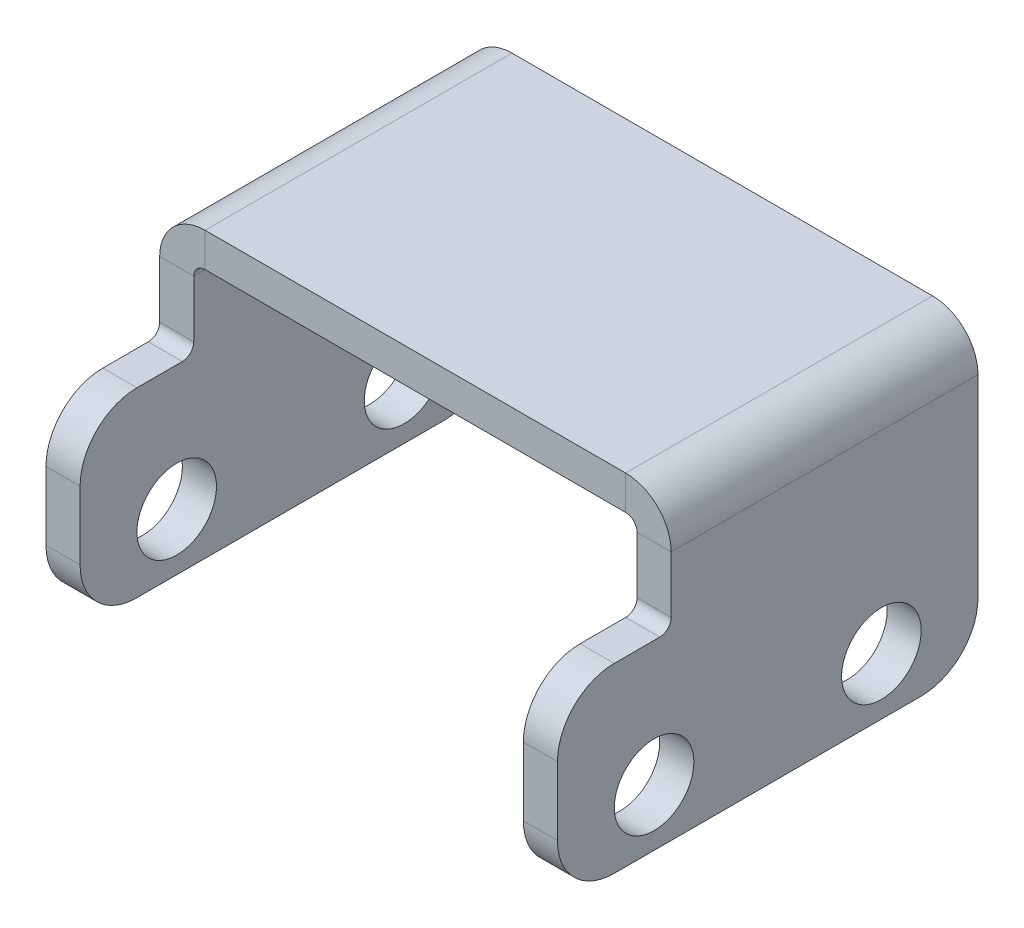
ISO-10303-21;
HEADER;
FILE_DESCRIPTION(('STEP AP214'),'2;1');
FILE_NAME('part.step','',(''),(''),'','','');
FILE_SCHEMA(('AUTOMOTIVE_DESIGN { 1 0 10303 214 1 1 1 1 }'));
ENDSEC;
DATA;
#1=APPLICATION_CONTEXT('core data for automotive mechanical design processes');
#2=APPLICATION_PROTOCOL_DEFINITION('international standard','automotive_design',2000,#1);
#3=PRODUCT_CONTEXT('',#1,'mechanical');
#4=PRODUCT('Part','Part','',(#3));
#5=PRODUCT_RELATED_PRODUCT_CATEGORY('part','',(#4));
#6=PRODUCT_DEFINITION_FORMATION('','',#4);
#7=PRODUCT_DEFINITION_CONTEXT('part definition',#1,'design');
#8=PRODUCT_DEFINITION('design','',#6,#7);
#9=PRODUCT_DEFINITION_SHAPE('','',#8);
#10=(LENGTH_UNIT() NAMED_UNIT(*) SI_UNIT(.MILLI.,.METRE.));
#11=(NAMED_UNIT(*) PLANE_ANGLE_UNIT() SI_UNIT($,.RADIAN.));
#12=(NAMED_UNIT(*) SI_UNIT($,.STERADIAN.) SOLID_ANGLE_UNIT());
#13=UNCERTAINTY_MEASURE_WITH_UNIT(LENGTH_MEASURE(1.E-05),#10,'distance_accuracy_value','');
#14=(GEOMETRIC_REPRESENTATION_CONTEXT(3) GLOBAL_UNCERTAINTY_ASSIGNED_CONTEXT((#13)) GLOBAL_UNIT_ASSIGNED_CONTEXT((#10,
#11,#12)) REPRESENTATION_CONTEXT('',''));
#15=CARTESIAN_POINT('',(0.,0.,0.));
#16=DIRECTION('',(0.,0.,1.));
#17=DIRECTION('',(1.,0.,0.));
#18=AXIS2_PLACEMENT_3D('',#15,#16,#17);
#19=CARTESIAN_POINT('',(-22.5,0.,-10.));
#20=DIRECTION('',(1.,0.,0.));
#21=DIRECTION('',(0.,0.,-1.));
#22=AXIS2_PLACEMENT_3D('',#19,#20,#21);
#23=CYLINDRICAL_SURFACE('',#22,3.5);
#24=CARTESIAN_POINT('',(-19.5,0.,-10.));
#25=DIRECTION('',(1.,0.,0.));
#26=DIRECTION('',(0.,1.,0.));
#27=AXIS2_PLACEMENT_3D('',#24,#25,#26);
#28=CIRCLE('',#27,3.5);
#29=CARTESIAN_POINT('',(-19.5,3.50000000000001,-10.));
#30=VERTEX_POINT('',#29);
#31=EDGE_CURVE('E350',#30,#30,#28,.T.);
#32=ORIENTED_EDGE('',*,*,#31,.T.);
#33=EDGE_LOOP('',(#32));
#34=FACE_BOUND('',#33,.T.);
#35=CARTESIAN_POINT('',(-22.5,0.,-10.));
#36=DIRECTION('',(1.,0.,0.));
#37=DIRECTION('',(0.,0.,-1.));
#38=AXIS2_PLACEMENT_3D('',#35,#36,#37);
#39=CIRCLE('',#38,3.5);
#40=CARTESIAN_POINT('',(-22.5,0.,-13.5));
#41=VERTEX_POINT('',#40);
#42=EDGE_CURVE('E379',#41,#41,#39,.T.);
#43=ORIENTED_EDGE('',*,*,#42,.F.);
#44=EDGE_LOOP('',(#43));
#45=FACE_BOUND('',#44,.T.);
#46=ADVANCED_FACE('F28',(#34,#45),#23,.F.);
#47=CARTESIAN_POINT('',(-22.5,-4.99999999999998,18.5));
#48=DIRECTION('',(-1.,0.,0.));
#49=DIRECTION('',(0.,-1.,0.));
#50=AXIS2_PLACEMENT_3D('',#47,#48,#49);
#51=PLANE('',#50);
#52=DIRECTION('',(0.,0.,1.));
#53=VECTOR('',#52,1.);
#54=CARTESIAN_POINT('',(-22.5,17.,8.5));
#55=LINE('',#54,#53);
#56=CARTESIAN_POINT('',(-22.5,17.,-18.5));
#57=VERTEX_POINT('',#56);
#58=CARTESIAN_POINT('',(-22.5,17.,8.5));
#59=VERTEX_POINT('',#58);
#60=EDGE_CURVE('E384',#57,#59,#55,.T.);
#61=ORIENTED_EDGE('',*,*,#60,.F.);
#62=DIRECTION('',(0.,1.,0.));
#63=VECTOR('',#62,1.);
#64=CARTESIAN_POINT('',(-22.5,-4.99999999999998,-18.5));
#65=LINE('',#64,#63);
#66=CARTESIAN_POINT('',(-22.5,0.,-18.5));
#67=VERTEX_POINT('',#66);
#68=EDGE_CURVE('E369',#67,#57,#65,.T.);
#69=ORIENTED_EDGE('',*,*,#68,.F.);
#70=CARTESIAN_POINT('',(-22.5,0.,-13.5));
#71=DIRECTION('',(-1.,0.,0.));
#72=DIRECTION('',(0.,-1.,0.));
#73=AXIS2_PLACEMENT_3D('',#70,#71,#72);
#74=CIRCLE('',#73,5.);
#75=CARTESIAN_POINT('',(-22.5,-4.99999999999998,-13.5));
#76=VERTEX_POINT('',#75);
#77=EDGE_CURVE('E372',#67,#76,#74,.T.);
#78=ORIENTED_EDGE('',*,*,#77,.T.);
#79=DIRECTION('',(0.,0.,-1.));
#80=VECTOR('',#79,1.);
#81=CARTESIAN_POINT('',(-22.5,-4.99999999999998,18.5));
#82=LINE('',#81,#80);
#83=CARTESIAN_POINT('',(-22.5,-4.99999999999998,13.5));
#84=VERTEX_POINT('',#83);
#85=EDGE_CURVE('E374',#84,#76,#82,.T.);
#86=ORIENTED_EDGE('',*,*,#85,.F.);
#87=CARTESIAN_POINT('',(-22.5,0.,13.5));
#88=DIRECTION('',(-1.,0.,0.));
#89=DIRECTION('',(0.,-1.,0.));
#90=AXIS2_PLACEMENT_3D('',#87,#88,#89);
#91=CIRCLE('',#90,5.);
#92=CARTESIAN_POINT('',(-22.5,0.,18.5));
#93=VERTEX_POINT('',#92);
#94=EDGE_CURVE('E377',#84,#93,#91,.T.);
#95=ORIENTED_EDGE('',*,*,#94,.T.);
#96=DIRECTION('',(0.,1.,0.));
#97=VECTOR('',#96,1.);
#98=CARTESIAN_POINT('',(-22.5,-4.99999999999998,18.5));
#99=LINE('',#98,#97);
#100=CARTESIAN_POINT('',(-22.5,6.00000000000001,18.5));
#101=VERTEX_POINT('',#100);
#102=EDGE_CURVE('E356',#93,#101,#99,.T.);
#103=ORIENTED_EDGE('',*,*,#102,.T.);
#104=CARTESIAN_POINT('',(-22.5,6.00000000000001,13.5));
#105=DIRECTION('',(-1.,0.,0.));
#106=DIRECTION('',(0.,-1.,0.));
#107=AXIS2_PLACEMENT_3D('',#104,#105,#106);
#108=CIRCLE('',#107,5.);
#109=CARTESIAN_POINT('',(-22.5,11.,13.5));
#110=VERTEX_POINT('',#109);
#111=EDGE_CURVE('E358',#101,#110,#108,.T.);
#112=ORIENTED_EDGE('',*,*,#111,.T.);
#113=DIRECTION('',(0.,0.,1.));
#114=VECTOR('',#113,1.);
#115=CARTESIAN_POINT('',(-22.5,11.,18.5));
#116=LINE('',#115,#114);
#117=CARTESIAN_POINT('',(-22.5,11.,9.50000000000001));
#118=VERTEX_POINT('',#117);
#119=EDGE_CURVE('E360',#118,#110,#116,.T.);
#120=ORIENTED_EDGE('',*,*,#119,.F.);
#121=CARTESIAN_POINT('',(-22.5,12.,9.5));
#122=DIRECTION('',(-1.,0.,0.));
#123=DIRECTION('',(0.,0.,1.));
#124=AXIS2_PLACEMENT_3D('',#121,#122,#123);
#125=CIRCLE('',#124,1.);
#126=CARTESIAN_POINT('',(-22.5,12.,8.5));
#127=VERTEX_POINT('',#126);
#128=EDGE_CURVE('E363',#127,#118,#125,.T.);
#129=ORIENTED_EDGE('',*,*,#128,.F.);
#130=DIRECTION('',(0.,-1.,0.));
#131=VECTOR('',#130,1.);
#132=CARTESIAN_POINT('',(-22.5,21.,8.5));
#133=LINE('',#132,#131);
#134=EDGE_CURVE('E366',#59,#127,#133,.T.);
#135=ORIENTED_EDGE('',*,*,#134,.F.);
#136=EDGE_LOOP('',(#61,#69,#78,#86,#95,#103,#112,#120,#129,#135));
#137=FACE_BOUND('',#136,.T.);
#138=CARTESIAN_POINT('',(-22.5,0.,10.));
#139=DIRECTION('',(1.,0.,0.));
#140=DIRECTION('',(0.,0.,-1.));
#141=AXIS2_PLACEMENT_3D('',#138,#139,#140);
#142=CIRCLE('',#141,3.5);
#143=CARTESIAN_POINT('',(-22.5,0.,6.5));
#144=VERTEX_POINT('',#143);
#145=EDGE_CURVE('E353',#144,#144,#142,.T.);
#146=ORIENTED_EDGE('',*,*,#145,.T.);
#147=EDGE_LOOP('',(#146));
#148=FACE_BOUND('',#147,.T.);
#149=ORIENTED_EDGE('',*,*,#42,.T.);
#150=EDGE_LOOP('',(#149));
#151=FACE_BOUND('',#150,.T.);
#152=ADVANCED_FACE('F460',(#137,#148,#151),#51,.T.);
#153=CARTESIAN_POINT('',(-22.5,0.,10.));
#154=DIRECTION('',(1.,0.,0.));
#155=DIRECTION('',(0.,0.,-1.));
#156=AXIS2_PLACEMENT_3D('',#153,#154,#155);
#157=CYLINDRICAL_SURFACE('',#156,3.5);
#158=CARTESIAN_POINT('',(-19.5,0.,10.));
#159=DIRECTION('',(1.,0.,0.));
#160=DIRECTION('',(0.,1.,0.));
#161=AXIS2_PLACEMENT_3D('',#158,#159,#160);
#162=CIRCLE('',#161,3.5);
#163=CARTESIAN_POINT('',(-19.5,3.50000000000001,10.));
#164=VERTEX_POINT('',#163);
#165=EDGE_CURVE('E347',#164,#164,#162,.T.);
#166=ORIENTED_EDGE('',*,*,#165,.T.);
#167=EDGE_LOOP('',(#166));
#168=FACE_BOUND('',#167,.T.);
#169=ORIENTED_EDGE('',*,*,#145,.F.);
#170=EDGE_LOOP('',(#169));
#171=FACE_BOUND('',#170,.T.);
#172=ADVANCED_FACE('F463',(#168,#171),#157,.F.);
#173=CARTESIAN_POINT('',(-19.5,18.,18.5));
#174=DIRECTION('',(1.,0.,0.));
#175=DIRECTION('',(0.,1.,0.));
#176=AXIS2_PLACEMENT_3D('',#173,#174,#175);
#177=PLANE('',#176);
#178=DIRECTION('',(0.,0.,-1.));
#179=VECTOR('',#178,1.);
#180=CARTESIAN_POINT('',(-19.5,17.,8.5));
#181=LINE('',#180,#179);
#182=CARTESIAN_POINT('',(-19.5,17.,8.50000000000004));
#183=VERTEX_POINT('',#182);
#184=CARTESIAN_POINT('',(-19.5,17.,-18.5));
#185=VERTEX_POINT('',#184);
#186=EDGE_CURVE('E382',#183,#185,#181,.T.);
#187=ORIENTED_EDGE('',*,*,#186,.F.);
#188=DIRECTION('',(0.,1.,0.));
#189=VECTOR('',#188,1.);
#190=CARTESIAN_POINT('',(-19.5,18.,8.5));
#191=LINE('',#190,#189);
#192=CARTESIAN_POINT('',(-19.5,12.,8.5));
#193=VERTEX_POINT('',#192);
#194=EDGE_CURVE('E341',#193,#183,#191,.T.);
#195=ORIENTED_EDGE('',*,*,#194,.F.);
#196=CARTESIAN_POINT('',(-19.5,12.,9.5));
#197=DIRECTION('',(1.,0.,0.));
#198=DIRECTION('',(0.,1.,0.));
#199=AXIS2_PLACEMENT_3D('',#196,#197,#198);
#200=CIRCLE('',#199,1.);
#201=CARTESIAN_POINT('',(-19.5,11.,9.50000000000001));
#202=VERTEX_POINT('',#201);
#203=EDGE_CURVE('E344',#202,#193,#200,.T.);
#204=ORIENTED_EDGE('',*,*,#203,.F.);
#205=DIRECTION('',(0.,0.,-1.));
#206=VECTOR('',#205,1.);
#207=CARTESIAN_POINT('',(-19.5,11.,18.5));
#208=LINE('',#207,#206);
#209=CARTESIAN_POINT('',(-19.5,11.,13.5));
#210=VERTEX_POINT('',#209);
#211=EDGE_CURVE('E329',#210,#202,#208,.T.);
#212=ORIENTED_EDGE('',*,*,#211,.F.);
#213=CARTESIAN_POINT('',(-19.5,6.00000000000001,13.5));
#214=DIRECTION('',(1.,0.,0.));
#215=DIRECTION('',(0.,1.,0.));
#216=AXIS2_PLACEMENT_3D('',#213,#214,#215);
#217=CIRCLE('',#216,5.);
#218=CARTESIAN_POINT('',(-19.5,6.00000000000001,18.5));
#219=VERTEX_POINT('',#218);
#220=EDGE_CURVE('E332',#210,#219,#217,.T.);
#221=ORIENTED_EDGE('',*,*,#220,.T.);
#222=DIRECTION('',(0.,-1.,0.));
#223=VECTOR('',#222,1.);
#224=CARTESIAN_POINT('',(-19.5,18.,18.5));
#225=LINE('',#224,#223);
#226=CARTESIAN_POINT('',(-19.5,0.,18.5));
#227=VERTEX_POINT('',#226);
#228=EDGE_CURVE('E334',#219,#227,#225,.T.);
#229=ORIENTED_EDGE('',*,*,#228,.T.);
#230=CARTESIAN_POINT('',(-19.5,0.,13.5));
#231=DIRECTION('',(1.,0.,0.));
#232=DIRECTION('',(0.,1.,0.));
#233=AXIS2_PLACEMENT_3D('',#230,#231,#232);
#234=CIRCLE('',#233,5.);
#235=CARTESIAN_POINT('',(-19.5,-4.99999999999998,13.5));
#236=VERTEX_POINT('',#235);
#237=EDGE_CURVE('E336',#227,#236,#234,.T.);
#238=ORIENTED_EDGE('',*,*,#237,.T.);
#239=DIRECTION('',(0.,0.,-1.));
#240=VECTOR('',#239,1.);
#241=CARTESIAN_POINT('',(-19.5,-4.99999999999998,18.5));
#242=LINE('',#241,#240);
#243=CARTESIAN_POINT('',(-19.5,-4.99999999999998,-13.5));
#244=VERTEX_POINT('',#243);
#245=EDGE_CURVE('E338',#236,#244,#242,.T.);
#246=ORIENTED_EDGE('',*,*,#245,.T.);
#247=CARTESIAN_POINT('',(-19.5,0.,-13.5));
#248=DIRECTION('',(1.,0.,0.));
#249=DIRECTION('',(0.,1.,0.));
#250=AXIS2_PLACEMENT_3D('',#247,#248,#249);
#251=CIRCLE('',#250,5.);
#252=CARTESIAN_POINT('',(-19.5,0.,-18.5));
#253=VERTEX_POINT('',#252);
#254=EDGE_CURVE('E43',#244,#253,#251,.T.);
#255=ORIENTED_EDGE('',*,*,#254,.T.);
#256=DIRECTION('',(0.,-1.,0.));
#257=VECTOR('',#256,1.);
#258=CARTESIAN_POINT('',(-19.5,18.,-18.5));
#259=LINE('',#258,#257);
#260=EDGE_CURVE('E11',#185,#253,#259,.T.);
#261=ORIENTED_EDGE('',*,*,#260,.F.);
#262=EDGE_LOOP('',(#187,#195,#204,#212,#221,#229,#238,#246,#255,#261));
#263=FACE_BOUND('',#262,.T.);
#264=ORIENTED_EDGE('',*,*,#165,.F.);
#265=EDGE_LOOP('',(#264));
#266=FACE_BOUND('',#265,.T.);
#267=ORIENTED_EDGE('',*,*,#31,.F.);
#268=EDGE_LOOP('',(#267));
#269=FACE_BOUND('',#268,.T.);
#270=ADVANCED_FACE('F414',(#263,#266,#269),#177,.T.);
#271=CARTESIAN_POINT('',(63.5929730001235,18.,8.5));
#272=DIRECTION('',(0.,0.,1.));
#273=DIRECTION('',(0.,1.,0.));
#274=AXIS2_PLACEMENT_3D('',#271,#272,#273);
#275=PLANE('',#274);
#276=DIRECTION('',(-1.,0.,0.));
#277=VECTOR('',#276,1.);
#278=CARTESIAN_POINT('',(63.5929730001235,17.,8.5));
#279=LINE('',#278,#277);
#280=EDGE_CURVE('E36',#183,#59,#279,.T.);
#281=ORIENTED_EDGE('',*,*,#280,.T.);
#282=ORIENTED_EDGE('',*,*,#134,.T.);
#283=DIRECTION('',(-1.,0.,0.));
#284=VECTOR('',#283,1.);
#285=CARTESIAN_POINT('',(63.5929730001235,12.,8.5));
#286=LINE('',#285,#284);
#287=EDGE_CURVE('E409',#193,#127,#286,.T.);
#288=ORIENTED_EDGE('',*,*,#287,.F.);
#289=ORIENTED_EDGE('',*,*,#194,.T.);
#290=EDGE_LOOP('',(#281,#282,#288,#289));
#291=FACE_BOUND('',#290,.T.);
#292=ADVANCED_FACE('F30',(#291),#275,.T.);
#293=CARTESIAN_POINT('',(63.5929730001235,12.,9.5));
#294=DIRECTION('',(-1.,0.,0.));
#295=DIRECTION('',(0.,-1.,0.));
#296=AXIS2_PLACEMENT_3D('',#293,#294,#295);
#297=CYLINDRICAL_SURFACE('',#296,1.);
#298=ORIENTED_EDGE('',*,*,#287,.T.);
#299=ORIENTED_EDGE('',*,*,#128,.T.);
#300=DIRECTION('',(-1.,0.,0.));
#301=VECTOR('',#300,1.);
#302=CARTESIAN_POINT('',(63.5929730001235,11.,9.50000000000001));
#303=LINE('',#302,#301);
#304=EDGE_CURVE('E406',#202,#118,#303,.T.);
#305=ORIENTED_EDGE('',*,*,#304,.F.);
#306=ORIENTED_EDGE('',*,*,#203,.T.);
#307=EDGE_LOOP('',(#298,#299,#305,#306));
#308=FACE_BOUND('',#307,.T.);
#309=ADVANCED_FACE('F418',(#308),#297,.F.);
#310=CARTESIAN_POINT('',(63.5929730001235,11.,18.5));
#311=DIRECTION('',(0.,1.,0.));
#312=DIRECTION('',(0.,0.,-1.));
#313=AXIS2_PLACEMENT_3D('',#310,#311,#312);
#314=PLANE('',#313);
#315=ORIENTED_EDGE('',*,*,#304,.T.);
#316=ORIENTED_EDGE('',*,*,#119,.T.);
#317=DIRECTION('',(-1.,0.,0.));
#318=VECTOR('',#317,1.);
#319=CARTESIAN_POINT('',(63.5929730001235,11.,13.5));
#320=LINE('',#319,#318);
#321=EDGE_CURVE('E403',#210,#110,#320,.T.);
#322=ORIENTED_EDGE('',*,*,#321,.F.);
#323=ORIENTED_EDGE('',*,*,#211,.T.);
#324=EDGE_LOOP('',(#315,#316,#322,#323));
#325=FACE_BOUND('',#324,.T.);
#326=ADVANCED_FACE('F420',(#325),#314,.T.);
#327=CARTESIAN_POINT('',(63.5929730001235,5.99999999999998,13.5));
#328=DIRECTION('',(-1.,0.,0.));
#329=DIRECTION('',(0.,-1.,0.));
#330=AXIS2_PLACEMENT_3D('',#327,#328,#329);
#331=CYLINDRICAL_SURFACE('',#330,5.);
#332=ORIENTED_EDGE('',*,*,#111,.F.);
#333=DIRECTION('',(-1.,0.,0.));
#334=VECTOR('',#333,1.);
#335=CARTESIAN_POINT('',(63.5929730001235,5.99999999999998,18.5));
#336=LINE('',#335,#334);
#337=EDGE_CURVE('E400',#219,#101,#336,.T.);
#338=ORIENTED_EDGE('',*,*,#337,.F.);
#339=ORIENTED_EDGE('',*,*,#220,.F.);
#340=ORIENTED_EDGE('',*,*,#321,.T.);
#341=EDGE_LOOP('',(#332,#338,#339,#340));
#342=FACE_BOUND('',#341,.T.);
#343=ADVANCED_FACE('F427',(#342),#331,.T.);
#344=CARTESIAN_POINT('',(63.5929730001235,18.,18.5));
#345=DIRECTION('',(0.,0.,-1.));
#346=DIRECTION('',(0.,-1.,0.));
#347=AXIS2_PLACEMENT_3D('',#344,#345,#346);
#348=PLANE('',#347);
#349=ORIENTED_EDGE('',*,*,#102,.F.);
#350=DIRECTION('',(-1.,0.,0.));
#351=VECTOR('',#350,1.);
#352=CARTESIAN_POINT('',(63.5929730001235,0.,18.5));
#353=LINE('',#352,#351);
#354=EDGE_CURVE('E397',#227,#93,#353,.T.);
#355=ORIENTED_EDGE('',*,*,#354,.F.);
#356=ORIENTED_EDGE('',*,*,#228,.F.);
#357=ORIENTED_EDGE('',*,*,#337,.T.);
#358=EDGE_LOOP('',(#349,#355,#356,#357));
#359=FACE_BOUND('',#358,.T.);
#360=ADVANCED_FACE('F430',(#359),#348,.F.);
#361=CARTESIAN_POINT('',(63.5929730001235,0.,13.5));
#362=DIRECTION('',(-1.,0.,0.));
#363=DIRECTION('',(0.,-1.,0.));
#364=AXIS2_PLACEMENT_3D('',#361,#362,#363);
#365=CYLINDRICAL_SURFACE('',#364,5.);
#366=ORIENTED_EDGE('',*,*,#94,.F.);
#367=DIRECTION('',(-1.,0.,0.));
#368=VECTOR('',#367,1.);
#369=CARTESIAN_POINT('',(63.5929730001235,-5.00000000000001,13.5));
#370=LINE('',#369,#368);
#371=EDGE_CURVE('E394',#236,#84,#370,.T.);
#372=ORIENTED_EDGE('',*,*,#371,.F.);
#373=ORIENTED_EDGE('',*,*,#237,.F.);
#374=ORIENTED_EDGE('',*,*,#354,.T.);
#375=EDGE_LOOP('',(#366,#372,#373,#374));
#376=FACE_BOUND('',#375,.T.);
#377=ADVANCED_FACE('F437',(#376),#365,.T.);
#378=CARTESIAN_POINT('',(63.5929730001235,-5.00000000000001,18.5));
#379=DIRECTION('',(0.,1.,0.));
#380=DIRECTION('',(-1.,0.,0.));
#381=AXIS2_PLACEMENT_3D('',#378,#379,#380);
#382=PLANE('',#381);
#383=ORIENTED_EDGE('',*,*,#85,.T.);
#384=DIRECTION('',(-1.,0.,0.));
#385=VECTOR('',#384,1.);
#386=CARTESIAN_POINT('',(63.5929730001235,-5.00000000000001,-13.5));
#387=LINE('',#386,#385);
#388=EDGE_CURVE('E391',#244,#76,#387,.T.);
#389=ORIENTED_EDGE('',*,*,#388,.F.);
#390=ORIENTED_EDGE('',*,*,#245,.F.);
#391=ORIENTED_EDGE('',*,*,#371,.T.);
#392=EDGE_LOOP('',(#383,#389,#390,#391));
#393=FACE_BOUND('',#392,.T.);
#394=ADVANCED_FACE('F439',(#393),#382,.F.);
#395=CARTESIAN_POINT('',(63.5929730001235,0.,-13.5));
#396=DIRECTION('',(-1.,0.,0.));
#397=DIRECTION('',(0.,-1.,0.));
#398=AXIS2_PLACEMENT_3D('',#395,#396,#397);
#399=CYLINDRICAL_SURFACE('',#398,5.);
#400=ORIENTED_EDGE('',*,*,#77,.F.);
#401=DIRECTION('',(-1.,0.,0.));
#402=VECTOR('',#401,1.);
#403=CARTESIAN_POINT('',(63.5929730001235,0.,-18.5));
#404=LINE('',#403,#402);
#405=EDGE_CURVE('E388',#253,#67,#404,.T.);
#406=ORIENTED_EDGE('',*,*,#405,.F.);
#407=ORIENTED_EDGE('',*,*,#254,.F.);
#408=ORIENTED_EDGE('',*,*,#388,.T.);
#409=EDGE_LOOP('',(#400,#406,#407,#408));
#410=FACE_BOUND('',#409,.T.);
#411=ADVANCED_FACE('F444',(#410),#399,.T.);
#412=CARTESIAN_POINT('',(63.5929730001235,18.,-18.5));
#413=DIRECTION('',(0.,0.,-1.));
#414=DIRECTION('',(0.,-1.,0.));
#415=AXIS2_PLACEMENT_3D('',#412,#413,#414);
#416=PLANE('',#415);
#417=ORIENTED_EDGE('',*,*,#405,.T.);
#418=ORIENTED_EDGE('',*,*,#68,.T.);
#419=DIRECTION('',(-1.,0.,0.));
#420=VECTOR('',#419,1.);
#421=CARTESIAN_POINT('',(63.5929730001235,17.,-18.5));
#422=LINE('',#421,#420);
#423=EDGE_CURVE('E386',#185,#57,#422,.T.);
#424=ORIENTED_EDGE('',*,*,#423,.F.);
#425=ORIENTED_EDGE('',*,*,#260,.T.);
#426=EDGE_LOOP('',(#417,#418,#424,#425));
#427=FACE_BOUND('',#426,.T.);
#428=ADVANCED_FACE('F446',(#427),#416,.T.);
#429=CARTESIAN_POINT('',(-22.5,0.,-10.));
#430=DIRECTION('',(1.,0.,0.));
#431=DIRECTION('',(0.,0.,-1.));
#432=AXIS2_PLACEMENT_3D('',#429,#430,#431);
#433=CYLINDRICAL_SURFACE('',#432,3.5);
#434=CARTESIAN_POINT('',(22.5,0.,-10.));
#435=DIRECTION('',(1.,0.,0.));
#436=DIRECTION('',(0.,0.,-1.));
#437=AXIS2_PLACEMENT_3D('',#434,#435,#436);
#438=CIRCLE('',#437,3.5);
#439=CARTESIAN_POINT('',(22.5,0.,-13.5));
#440=VERTEX_POINT('',#439);
#441=EDGE_CURVE('E270',#440,#440,#438,.T.);
#442=ORIENTED_EDGE('',*,*,#441,.T.);
#443=EDGE_LOOP('',(#442));
#444=FACE_BOUND('',#443,.T.);
#445=CARTESIAN_POINT('',(19.5,0.,-10.));
#446=DIRECTION('',(1.,0.,0.));
#447=DIRECTION('',(0.,0.,-1.));
#448=AXIS2_PLACEMENT_3D('',#445,#446,#447);
#449=CIRCLE('',#448,3.5);
#450=CARTESIAN_POINT('',(19.5,0.,-13.5));
#451=VERTEX_POINT('',#450);
#452=EDGE_CURVE('E243',#451,#451,#449,.T.);
#453=ORIENTED_EDGE('',*,*,#452,.F.);
#454=EDGE_LOOP('',(#453));
#455=FACE_BOUND('',#454,.T.);
#456=ADVANCED_FACE('F490',(#444,#455),#433,.F.);
#457=CARTESIAN_POINT('',(22.5,-5.,18.5));
#458=DIRECTION('',(-1.,0.,0.));
#459=DIRECTION('',(0.,-1.,0.));
#460=AXIS2_PLACEMENT_3D('',#457,#458,#459);
#461=PLANE('',#460);
#462=CARTESIAN_POINT('',(22.5,0.,10.));
#463=DIRECTION('',(1.,0.,0.));
#464=DIRECTION('',(0.,0.,-1.));
#465=AXIS2_PLACEMENT_3D('',#462,#463,#464);
#466=CIRCLE('',#465,3.5);
#467=CARTESIAN_POINT('',(22.5,0.,6.5));
#468=VERTEX_POINT('',#467);
#469=EDGE_CURVE('E267',#468,#468,#466,.T.);
#470=ORIENTED_EDGE('',*,*,#469,.F.);
#471=EDGE_LOOP('',(#470));
#472=FACE_BOUND('',#471,.T.);
#473=ORIENTED_EDGE('',*,*,#441,.F.);
#474=EDGE_LOOP('',(#473));
#475=FACE_BOUND('',#474,.T.);
#476=DIRECTION('',(0.,1.,0.));
#477=VECTOR('',#476,1.);
#478=CARTESIAN_POINT('',(22.5,-5.,-18.5));
#479=LINE('',#478,#477);
#480=CARTESIAN_POINT('',(22.5,0.,-18.5));
#481=VERTEX_POINT('',#480);
#482=CARTESIAN_POINT('',(22.5,17.,-18.5));
#483=VERTEX_POINT('',#482);
#484=EDGE_CURVE('E286',#481,#483,#479,.T.);
#485=ORIENTED_EDGE('',*,*,#484,.T.);
#486=DIRECTION('',(0.,0.,1.));
#487=VECTOR('',#486,1.);
#488=CARTESIAN_POINT('',(22.5,17.,-18.5));
#489=LINE('',#488,#487);
#490=CARTESIAN_POINT('',(22.5,17.,8.49999999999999));
#491=VERTEX_POINT('',#490);
#492=EDGE_CURVE('E294',#483,#491,#489,.T.);
#493=ORIENTED_EDGE('',*,*,#492,.T.);
#494=DIRECTION('',(0.,1.,0.));
#495=VECTOR('',#494,1.);
#496=CARTESIAN_POINT('',(22.5,18.,8.5));
#497=LINE('',#496,#495);
#498=CARTESIAN_POINT('',(22.5,12.,8.5));
#499=VERTEX_POINT('',#498);
#500=EDGE_CURVE('E326',#499,#491,#497,.T.);
#501=ORIENTED_EDGE('',*,*,#500,.F.);
#502=CARTESIAN_POINT('',(22.5,12.,9.5));
#503=DIRECTION('',(-1.,0.,0.));
#504=DIRECTION('',(0.,0.,1.));
#505=AXIS2_PLACEMENT_3D('',#502,#503,#504);
#506=CIRCLE('',#505,1.);
#507=CARTESIAN_POINT('',(22.5,11.,9.50000000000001));
#508=VERTEX_POINT('',#507);
#509=EDGE_CURVE('E289',#499,#508,#506,.T.);
#510=ORIENTED_EDGE('',*,*,#509,.T.);
#511=DIRECTION('',(0.,0.,1.));
#512=VECTOR('',#511,1.);
#513=CARTESIAN_POINT('',(22.5,11.,18.5));
#514=LINE('',#513,#512);
#515=CARTESIAN_POINT('',(22.5,11.,13.5));
#516=VERTEX_POINT('',#515);
#517=EDGE_CURVE('E273',#508,#516,#514,.T.);
#518=ORIENTED_EDGE('',*,*,#517,.T.);
#519=CARTESIAN_POINT('',(22.5,6.00000000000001,13.5));
#520=DIRECTION('',(-1.,0.,0.));
#521=DIRECTION('',(0.,-1.,0.));
#522=AXIS2_PLACEMENT_3D('',#519,#520,#521);
#523=CIRCLE('',#522,5.);
#524=CARTESIAN_POINT('',(22.5,6.,18.5));
#525=VERTEX_POINT('',#524);
#526=EDGE_CURVE('E275',#516,#525,#523,.F.);
#527=ORIENTED_EDGE('',*,*,#526,.T.);
#528=DIRECTION('',(0.,1.,0.));
#529=VECTOR('',#528,1.);
#530=CARTESIAN_POINT('',(22.5,-5.,18.5));
#531=LINE('',#530,#529);
#532=CARTESIAN_POINT('',(22.5,0.,18.5));
#533=VERTEX_POINT('',#532);
#534=EDGE_CURVE('E277',#533,#525,#531,.T.);
#535=ORIENTED_EDGE('',*,*,#534,.F.);
#536=CARTESIAN_POINT('',(22.5,0.,13.5));
#537=DIRECTION('',(-1.,0.,0.));
#538=DIRECTION('',(0.,-1.,0.));
#539=AXIS2_PLACEMENT_3D('',#536,#537,#538);
#540=CIRCLE('',#539,5.);
#541=CARTESIAN_POINT('',(22.5,-5.,13.5));
#542=VERTEX_POINT('',#541);
#543=EDGE_CURVE('E280',#533,#542,#540,.F.);
#544=ORIENTED_EDGE('',*,*,#543,.T.);
#545=DIRECTION('',(0.,0.,-1.));
#546=VECTOR('',#545,1.);
#547=CARTESIAN_POINT('',(22.5,-5.,18.5));
#548=LINE('',#547,#546);
#549=CARTESIAN_POINT('',(22.5,-5.,-13.5));
#550=VERTEX_POINT('',#549);
#551=EDGE_CURVE('E282',#542,#550,#548,.T.);
#552=ORIENTED_EDGE('',*,*,#551,.T.);
#553=CARTESIAN_POINT('',(22.5,0.,-13.5));
#554=DIRECTION('',(-1.,0.,0.));
#555=DIRECTION('',(0.,-1.,0.));
#556=AXIS2_PLACEMENT_3D('',#553,#554,#555);
#557=CIRCLE('',#556,5.);
#558=EDGE_CURVE('E284',#550,#481,#557,.F.);
#559=ORIENTED_EDGE('',*,*,#558,.T.);
#560=EDGE_LOOP('',(#485,#493,#501,#510,#518,#527,#535,#544,#552,#559));
#561=FACE_BOUND('',#560,.T.);
#562=ADVANCED_FACE('F525',(#472,#475,#561),#461,.F.);
#563=CARTESIAN_POINT('',(-22.5,0.,10.));
#564=DIRECTION('',(1.,0.,0.));
#565=DIRECTION('',(0.,0.,-1.));
#566=AXIS2_PLACEMENT_3D('',#563,#564,#565);
#567=CYLINDRICAL_SURFACE('',#566,3.5);
#568=ORIENTED_EDGE('',*,*,#469,.T.);
#569=EDGE_LOOP('',(#568));
#570=FACE_BOUND('',#569,.T.);
#571=CARTESIAN_POINT('',(19.5,0.,10.));
#572=DIRECTION('',(1.,0.,0.));
#573=DIRECTION('',(0.,0.,-1.));
#574=AXIS2_PLACEMENT_3D('',#571,#572,#573);
#575=CIRCLE('',#574,3.5);
#576=CARTESIAN_POINT('',(19.5,0.,6.5));
#577=VERTEX_POINT('',#576);
#578=EDGE_CURVE('E240',#577,#577,#575,.T.);
#579=ORIENTED_EDGE('',*,*,#578,.F.);
#580=EDGE_LOOP('',(#579));
#581=FACE_BOUND('',#580,.T.);
#582=ADVANCED_FACE('F529',(#570,#581),#567,.F.);
#583=CARTESIAN_POINT('',(19.5,18.,18.5));
#584=DIRECTION('',(1.,0.,0.));
#585=DIRECTION('',(0.,0.,-1.));
#586=AXIS2_PLACEMENT_3D('',#583,#584,#585);
#587=PLANE('',#586);
#588=ORIENTED_EDGE('',*,*,#578,.T.);
#589=EDGE_LOOP('',(#588));
#590=FACE_BOUND('',#589,.T.);
#591=ORIENTED_EDGE('',*,*,#452,.T.);
#592=EDGE_LOOP('',(#591));
#593=FACE_BOUND('',#592,.T.);
#594=DIRECTION('',(0.,1.,0.));
#595=VECTOR('',#594,1.);
#596=CARTESIAN_POINT('',(19.5,18.,8.5));
#597=LINE('',#596,#595);
#598=CARTESIAN_POINT('',(19.5,12.,8.5));
#599=VERTEX_POINT('',#598);
#600=CARTESIAN_POINT('',(19.5,17.,8.49999999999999));
#601=VERTEX_POINT('',#600);
#602=EDGE_CURVE('E255',#599,#601,#597,.T.);
#603=ORIENTED_EDGE('',*,*,#602,.T.);
#604=DIRECTION('',(0.,0.,-1.));
#605=VECTOR('',#604,1.);
#606=CARTESIAN_POINT('',(19.5,17.,-18.5));
#607=LINE('',#606,#605);
#608=CARTESIAN_POINT('',(19.5,17.,-18.5));
#609=VERTEX_POINT('',#608);
#610=EDGE_CURVE('E291',#601,#609,#607,.T.);
#611=ORIENTED_EDGE('',*,*,#610,.T.);
#612=DIRECTION('',(0.,-1.,0.));
#613=VECTOR('',#612,1.);
#614=CARTESIAN_POINT('',(19.5,18.,-18.5));
#615=LINE('',#614,#613);
#616=CARTESIAN_POINT('',(19.5,0.,-18.5));
#617=VERTEX_POINT('',#616);
#618=EDGE_CURVE('E258',#609,#617,#615,.T.);
#619=ORIENTED_EDGE('',*,*,#618,.T.);
#620=CARTESIAN_POINT('',(19.5,0.,-13.5));
#621=DIRECTION('',(1.,0.,0.));
#622=DIRECTION('',(0.,0.,-1.));
#623=AXIS2_PLACEMENT_3D('',#620,#621,#622);
#624=CIRCLE('',#623,5.);
#625=CARTESIAN_POINT('',(19.5,-5.,-13.5));
#626=VERTEX_POINT('',#625);
#627=EDGE_CURVE('E260',#617,#626,#624,.F.);
#628=ORIENTED_EDGE('',*,*,#627,.T.);
#629=DIRECTION('',(0.,0.,-1.));
#630=VECTOR('',#629,1.);
#631=CARTESIAN_POINT('',(19.5,-5.,18.5));
#632=LINE('',#631,#630);
#633=CARTESIAN_POINT('',(19.5,-5.,13.5));
#634=VERTEX_POINT('',#633);
#635=EDGE_CURVE('E262',#634,#626,#632,.T.);
#636=ORIENTED_EDGE('',*,*,#635,.F.);
#637=CARTESIAN_POINT('',(19.5,0.,13.5));
#638=DIRECTION('',(1.,0.,0.));
#639=DIRECTION('',(0.,0.,-1.));
#640=AXIS2_PLACEMENT_3D('',#637,#638,#639);
#641=CIRCLE('',#640,5.);
#642=CARTESIAN_POINT('',(19.5,0.,18.5));
#643=VERTEX_POINT('',#642);
#644=EDGE_CURVE('E265',#634,#643,#641,.F.);
#645=ORIENTED_EDGE('',*,*,#644,.T.);
#646=DIRECTION('',(0.,-1.,0.));
#647=VECTOR('',#646,1.);
#648=CARTESIAN_POINT('',(19.5,18.,18.5));
#649=LINE('',#648,#647);
#650=CARTESIAN_POINT('',(19.5,6.00000000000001,18.5));
#651=VERTEX_POINT('',#650);
#652=EDGE_CURVE('E246',#651,#643,#649,.T.);
#653=ORIENTED_EDGE('',*,*,#652,.F.);
#654=CARTESIAN_POINT('',(19.5,6.00000000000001,13.5));
#655=DIRECTION('',(1.,0.,0.));
#656=DIRECTION('',(0.,0.,-1.));
#657=AXIS2_PLACEMENT_3D('',#654,#655,#656);
#658=CIRCLE('',#657,5.);
#659=CARTESIAN_POINT('',(19.5,11.,13.5));
#660=VERTEX_POINT('',#659);
#661=EDGE_CURVE('E249',#651,#660,#658,.F.);
#662=ORIENTED_EDGE('',*,*,#661,.T.);
#663=DIRECTION('',(0.,0.,-1.));
#664=VECTOR('',#663,1.);
#665=CARTESIAN_POINT('',(19.5,11.,18.5));
#666=LINE('',#665,#664);
#667=CARTESIAN_POINT('',(19.5,11.,9.50000000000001));
#668=VERTEX_POINT('',#667);
#669=EDGE_CURVE('E251',#660,#668,#666,.T.);
#670=ORIENTED_EDGE('',*,*,#669,.T.);
#671=CARTESIAN_POINT('',(19.5,12.,9.5));
#672=DIRECTION('',(1.,0.,0.));
#673=DIRECTION('',(0.,0.,-1.));
#674=AXIS2_PLACEMENT_3D('',#671,#672,#673);
#675=CIRCLE('',#674,1.);
#676=EDGE_CURVE('E253',#668,#599,#675,.T.);
#677=ORIENTED_EDGE('',*,*,#676,.T.);
#678=EDGE_LOOP('',(#603,#611,#619,#628,#636,#645,#653,#662,#670,#677));
#679=FACE_BOUND('',#678,.T.);
#680=ADVANCED_FACE('F488',(#590,#593,#679),#587,.F.);
#681=CARTESIAN_POINT('',(-63.5929730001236,18.,-18.5));
#682=DIRECTION('',(0.,0.,1.));
#683=DIRECTION('',(0.,-1.,0.));
#684=AXIS2_PLACEMENT_3D('',#681,#682,#683);
#685=PLANE('',#684);
#686=DIRECTION('',(1.,0.,0.));
#687=VECTOR('',#686,1.);
#688=CARTESIAN_POINT('',(-63.5929730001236,17.,-18.5));
#689=LINE('',#688,#687);
#690=EDGE_CURVE('E323',#609,#483,#689,.T.);
#691=ORIENTED_EDGE('',*,*,#690,.T.);
#692=ORIENTED_EDGE('',*,*,#484,.F.);
#693=DIRECTION('',(1.,0.,0.));
#694=VECTOR('',#693,1.);
#695=CARTESIAN_POINT('',(-63.5929730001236,0.,-18.5));
#696=LINE('',#695,#694);
#697=EDGE_CURVE('E320',#617,#481,#696,.T.);
#698=ORIENTED_EDGE('',*,*,#697,.F.);
#699=ORIENTED_EDGE('',*,*,#618,.F.);
#700=EDGE_LOOP('',(#691,#692,#698,#699));
#701=FACE_BOUND('',#700,.T.);
#702=ADVANCED_FACE('F484',(#701),#685,.F.);
#703=CARTESIAN_POINT('',(-63.5929730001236,0.,-13.5));
#704=DIRECTION('',(1.,0.,0.));
#705=DIRECTION('',(0.,1.,0.));
#706=AXIS2_PLACEMENT_3D('',#703,#704,#705);
#707=CYLINDRICAL_SURFACE('',#706,5.);
#708=ORIENTED_EDGE('',*,*,#697,.T.);
#709=ORIENTED_EDGE('',*,*,#558,.F.);
#710=DIRECTION('',(1.,0.,0.));
#711=VECTOR('',#710,1.);
#712=CARTESIAN_POINT('',(-63.5929730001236,-5.,-13.5));
#713=LINE('',#712,#711);
#714=EDGE_CURVE('E317',#626,#550,#713,.T.);
#715=ORIENTED_EDGE('',*,*,#714,.F.);
#716=ORIENTED_EDGE('',*,*,#627,.F.);
#717=EDGE_LOOP('',(#708,#709,#715,#716));
#718=FACE_BOUND('',#717,.T.);
#719=ADVANCED_FACE('F487',(#718),#707,.T.);
#720=CARTESIAN_POINT('',(-63.5929730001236,-5.,18.5));
#721=DIRECTION('',(0.,-1.,0.));
#722=DIRECTION('',(1.,0.,0.));
#723=AXIS2_PLACEMENT_3D('',#720,#721,#722);
#724=PLANE('',#723);
#725=ORIENTED_EDGE('',*,*,#551,.F.);
#726=DIRECTION('',(1.,0.,0.));
#727=VECTOR('',#726,1.);
#728=CARTESIAN_POINT('',(-63.5929730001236,-5.,13.5));
#729=LINE('',#728,#727);
#730=EDGE_CURVE('E314',#634,#542,#729,.T.);
#731=ORIENTED_EDGE('',*,*,#730,.F.);
#732=ORIENTED_EDGE('',*,*,#635,.T.);
#733=ORIENTED_EDGE('',*,*,#714,.T.);
#734=EDGE_LOOP('',(#725,#731,#732,#733));
#735=FACE_BOUND('',#734,.T.);
#736=ADVANCED_FACE('F493',(#735),#724,.T.);
#737=CARTESIAN_POINT('',(-63.5929730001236,0.,13.5));
#738=DIRECTION('',(1.,0.,0.));
#739=DIRECTION('',(0.,1.,0.));
#740=AXIS2_PLACEMENT_3D('',#737,#738,#739);
#741=CYLINDRICAL_SURFACE('',#740,5.);
#742=ORIENTED_EDGE('',*,*,#730,.T.);
#743=ORIENTED_EDGE('',*,*,#543,.F.);
#744=DIRECTION('',(1.,0.,0.));
#745=VECTOR('',#744,1.);
#746=CARTESIAN_POINT('',(-63.5929730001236,0.,18.5));
#747=LINE('',#746,#745);
#748=EDGE_CURVE('E311',#643,#533,#747,.T.);
#749=ORIENTED_EDGE('',*,*,#748,.F.);
#750=ORIENTED_EDGE('',*,*,#644,.F.);
#751=EDGE_LOOP('',(#742,#743,#749,#750));
#752=FACE_BOUND('',#751,.T.);
#753=ADVANCED_FACE('F497',(#752),#741,.T.);
#754=CARTESIAN_POINT('',(-63.5929730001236,18.,18.5));
#755=DIRECTION('',(0.,0.,1.));
#756=DIRECTION('',(0.,-1.,0.));
#757=AXIS2_PLACEMENT_3D('',#754,#755,#756);
#758=PLANE('',#757);
#759=ORIENTED_EDGE('',*,*,#534,.T.);
#760=DIRECTION('',(1.,0.,0.));
#761=VECTOR('',#760,1.);
#762=CARTESIAN_POINT('',(-63.5929730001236,6.00000000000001,18.5));
#763=LINE('',#762,#761);
#764=EDGE_CURVE('E308',#651,#525,#763,.T.);
#765=ORIENTED_EDGE('',*,*,#764,.F.);
#766=ORIENTED_EDGE('',*,*,#652,.T.);
#767=ORIENTED_EDGE('',*,*,#748,.T.);
#768=EDGE_LOOP('',(#759,#765,#766,#767));
#769=FACE_BOUND('',#768,.T.);
#770=ADVANCED_FACE('F501',(#769),#758,.T.);
#771=CARTESIAN_POINT('',(-63.5929730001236,6.00000000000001,13.5));
#772=DIRECTION('',(1.,0.,0.));
#773=DIRECTION('',(0.,1.,0.));
#774=AXIS2_PLACEMENT_3D('',#771,#772,#773);
#775=CYLINDRICAL_SURFACE('',#774,5.);
#776=ORIENTED_EDGE('',*,*,#764,.T.);
#777=ORIENTED_EDGE('',*,*,#526,.F.);
#778=DIRECTION('',(1.,0.,0.));
#779=VECTOR('',#778,1.);
#780=CARTESIAN_POINT('',(-63.5929730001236,11.,13.5));
#781=LINE('',#780,#779);
#782=EDGE_CURVE('E305',#660,#516,#781,.T.);
#783=ORIENTED_EDGE('',*,*,#782,.F.);
#784=ORIENTED_EDGE('',*,*,#661,.F.);
#785=EDGE_LOOP('',(#776,#777,#783,#784));
#786=FACE_BOUND('',#785,.T.);
#787=ADVANCED_FACE('F505',(#786),#775,.T.);
#788=CARTESIAN_POINT('',(-63.5929730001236,11.,18.5));
#789=DIRECTION('',(0.,-1.,0.));
#790=DIRECTION('',(0.,0.,-1.));
#791=AXIS2_PLACEMENT_3D('',#788,#789,#790);
#792=PLANE('',#791);
#793=ORIENTED_EDGE('',*,*,#782,.T.);
#794=ORIENTED_EDGE('',*,*,#517,.F.);
#795=DIRECTION('',(1.,0.,0.));
#796=VECTOR('',#795,1.);
#797=CARTESIAN_POINT('',(-63.5929730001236,11.,9.50000000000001));
#798=LINE('',#797,#796);
#799=EDGE_CURVE('E302',#668,#508,#798,.T.);
#800=ORIENTED_EDGE('',*,*,#799,.F.);
#801=ORIENTED_EDGE('',*,*,#669,.F.);
#802=EDGE_LOOP('',(#793,#794,#800,#801));
#803=FACE_BOUND('',#802,.T.);
#804=ADVANCED_FACE('F509',(#803),#792,.F.);
#805=CARTESIAN_POINT('',(-63.5929730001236,12.,9.5));
#806=DIRECTION('',(1.,0.,0.));
#807=DIRECTION('',(0.,1.,0.));
#808=AXIS2_PLACEMENT_3D('',#805,#806,#807);
#809=CYLINDRICAL_SURFACE('',#808,1.);
#810=ORIENTED_EDGE('',*,*,#799,.T.);
#811=ORIENTED_EDGE('',*,*,#509,.F.);
#812=DIRECTION('',(1.,0.,0.));
#813=VECTOR('',#812,1.);
#814=CARTESIAN_POINT('',(-63.5929730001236,12.,8.5));
#815=LINE('',#814,#813);
#816=EDGE_CURVE('E299',#599,#499,#815,.T.);
#817=ORIENTED_EDGE('',*,*,#816,.F.);
#818=ORIENTED_EDGE('',*,*,#676,.F.);
#819=EDGE_LOOP('',(#810,#811,#817,#818));
#820=FACE_BOUND('',#819,.T.);
#821=ADVANCED_FACE('F513',(#820),#809,.F.);
#822=CARTESIAN_POINT('',(-63.5929730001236,18.,8.5));
#823=DIRECTION('',(0.,0.,-1.));
#824=DIRECTION('',(0.,1.,0.));
#825=AXIS2_PLACEMENT_3D('',#822,#823,#824);
#826=PLANE('',#825);
#827=ORIENTED_EDGE('',*,*,#816,.T.);
#828=ORIENTED_EDGE('',*,*,#500,.T.);
#829=DIRECTION('',(1.,0.,0.));
#830=VECTOR('',#829,1.);
#831=CARTESIAN_POINT('',(-63.5929730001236,17.,8.5));
#832=LINE('',#831,#830);
#833=EDGE_CURVE('E297',#601,#491,#832,.T.);
#834=ORIENTED_EDGE('',*,*,#833,.F.);
#835=ORIENTED_EDGE('',*,*,#602,.F.);
#836=EDGE_LOOP('',(#827,#828,#834,#835));
#837=FACE_BOUND('',#836,.T.);
#838=ADVANCED_FACE('F517',(#837),#826,.F.);
#839=CARTESIAN_POINT('',(-19.5,-70.6078599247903,-18.5));
#840=DIRECTION('',(0.,0.,1.));
#841=DIRECTION('',(1.,0.,0.));
#842=AXIS2_PLACEMENT_3D('',#839,#840,#841);
#843=PLANE('',#842);
#844=DIRECTION('',(0.,1.,0.));
#845=VECTOR('',#844,1.);
#846=CARTESIAN_POINT('',(-18.5,-70.6078599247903,-18.5));
#847=LINE('',#846,#845);
#848=CARTESIAN_POINT('',(-18.5,18.,-18.5));
#849=VERTEX_POINT('',#848);
#850=CARTESIAN_POINT('',(-18.5,21.,-18.5));
#851=VERTEX_POINT('',#850);
#852=EDGE_CURVE('E218',#849,#851,#847,.T.);
#853=ORIENTED_EDGE('',*,*,#852,.T.);
#854=DIRECTION('',(-1.,0.,0.));
#855=VECTOR('',#854,1.);
#856=CARTESIAN_POINT('',(22.5,21.,-18.5));
#857=LINE('',#856,#855);
#858=CARTESIAN_POINT('',(18.5,21.,-18.5));
#859=VERTEX_POINT('',#858);
#860=EDGE_CURVE('E229',#859,#851,#857,.T.);
#861=ORIENTED_EDGE('',*,*,#860,.F.);
#862=DIRECTION('',(0.,1.,0.));
#863=VECTOR('',#862,1.);
#864=CARTESIAN_POINT('',(18.5,-70.6078599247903,-18.5));
#865=LINE('',#864,#863);
#866=CARTESIAN_POINT('',(18.5,18.,-18.5));
#867=VERTEX_POINT('',#866);
#868=EDGE_CURVE('E207',#867,#859,#865,.T.);
#869=ORIENTED_EDGE('',*,*,#868,.F.);
#870=DIRECTION('',(1.,0.,0.));
#871=VECTOR('',#870,1.);
#872=CARTESIAN_POINT('',(-19.5,18.,-18.5));
#873=LINE('',#872,#871);
#874=EDGE_CURVE('E224',#849,#867,#873,.T.);
#875=ORIENTED_EDGE('',*,*,#874,.F.);
#876=EDGE_LOOP('',(#853,#861,#869,#875));
#877=FACE_BOUND('',#876,.T.);
#878=ADVANCED_FACE('F521',(#877),#843,.F.);
#879=CARTESIAN_POINT('',(-19.5,-70.6078599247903,8.5));
#880=DIRECTION('',(0.,0.,-1.));
#881=DIRECTION('',(-1.,0.,0.));
#882=AXIS2_PLACEMENT_3D('',#879,#880,#881);
#883=PLANE('',#882);
#884=DIRECTION('',(0.,1.,0.));
#885=VECTOR('',#884,1.);
#886=CARTESIAN_POINT('',(18.5,-70.6078599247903,8.5));
#887=LINE('',#886,#885);
#888=CARTESIAN_POINT('',(18.5,18.,8.49999999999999));
#889=VERTEX_POINT('',#888);
#890=CARTESIAN_POINT('',(18.5,21.,8.5));
#891=VERTEX_POINT('',#890);
#892=EDGE_CURVE('E217',#889,#891,#887,.T.);
#893=ORIENTED_EDGE('',*,*,#892,.T.);
#894=DIRECTION('',(-1.,0.,0.));
#895=VECTOR('',#894,1.);
#896=CARTESIAN_POINT('',(22.5,21.,8.5));
#897=LINE('',#896,#895);
#898=CARTESIAN_POINT('',(-18.5,21.,8.50000000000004));
#899=VERTEX_POINT('',#898);
#900=EDGE_CURVE('E216',#891,#899,#897,.T.);
#901=ORIENTED_EDGE('',*,*,#900,.T.);
#902=DIRECTION('',(0.,1.,0.));
#903=VECTOR('',#902,1.);
#904=CARTESIAN_POINT('',(-18.5,-70.6078599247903,8.5));
#905=LINE('',#904,#903);
#906=CARTESIAN_POINT('',(-18.5,18.,8.50000000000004));
#907=VERTEX_POINT('',#906);
#908=EDGE_CURVE('E191',#907,#899,#905,.T.);
#909=ORIENTED_EDGE('',*,*,#908,.F.);
#910=DIRECTION('',(-1.,0.,0.));
#911=VECTOR('',#910,1.);
#912=CARTESIAN_POINT('',(-19.5,18.,8.5));
#913=LINE('',#912,#911);
#914=EDGE_CURVE('E214',#889,#907,#913,.T.);
#915=ORIENTED_EDGE('',*,*,#914,.F.);
#916=EDGE_LOOP('',(#893,#901,#909,#915));
#917=FACE_BOUND('',#916,.T.);
#918=ADVANCED_FACE('F213',(#917),#883,.F.);
#919=CARTESIAN_POINT('',(-19.5,18.,18.5));
#920=DIRECTION('',(0.,1.,0.));
#921=DIRECTION('',(-1.,0.,0.));
#922=AXIS2_PLACEMENT_3D('',#919,#920,#921);
#923=PLANE('',#922);
#924=DIRECTION('',(0.,0.,-1.));
#925=VECTOR('',#924,1.);
#926=CARTESIAN_POINT('',(18.5,18.,-18.5));
#927=LINE('',#926,#925);
#928=EDGE_CURVE('E223',#889,#867,#927,.T.);
#929=ORIENTED_EDGE('',*,*,#928,.F.);
#930=ORIENTED_EDGE('',*,*,#914,.T.);
#931=DIRECTION('',(0.,0.,1.));
#932=VECTOR('',#931,1.);
#933=CARTESIAN_POINT('',(-18.5,18.,8.5));
#934=LINE('',#933,#932);
#935=EDGE_CURVE('E199',#849,#907,#934,.T.);
#936=ORIENTED_EDGE('',*,*,#935,.F.);
#937=ORIENTED_EDGE('',*,*,#874,.T.);
#938=EDGE_LOOP('',(#929,#930,#936,#937));
#939=FACE_BOUND('',#938,.T.);
#940=ADVANCED_FACE('F221',(#939),#923,.F.);
#941=CARTESIAN_POINT('',(22.5,21.,18.5));
#942=DIRECTION('',(0.,-1.,0.));
#943=DIRECTION('',(1.,0.,0.));
#944=AXIS2_PLACEMENT_3D('',#941,#942,#943);
#945=PLANE('',#944);
#946=DIRECTION('',(0.,0.,1.));
#947=VECTOR('',#946,1.);
#948=CARTESIAN_POINT('',(18.5,21.,-18.5));
#949=LINE('',#948,#947);
#950=EDGE_CURVE('E225',#859,#891,#949,.T.);
#951=ORIENTED_EDGE('',*,*,#950,.F.);
#952=ORIENTED_EDGE('',*,*,#860,.T.);
#953=DIRECTION('',(0.,0.,-1.));
#954=VECTOR('',#953,1.);
#955=CARTESIAN_POINT('',(-18.5,21.,8.5));
#956=LINE('',#955,#954);
#957=EDGE_CURVE('E206',#899,#851,#956,.T.);
#958=ORIENTED_EDGE('',*,*,#957,.F.);
#959=ORIENTED_EDGE('',*,*,#900,.F.);
#960=EDGE_LOOP('',(#951,#952,#958,#959));
#961=FACE_BOUND('',#960,.T.);
#962=ADVANCED_FACE('F544',(#961),#945,.F.);
#963=CARTESIAN_POINT('',(18.5,17.,-18.5));
#964=DIRECTION('',(0.,0.,-1.));
#965=DIRECTION('',(-1.,0.,0.));
#966=AXIS2_PLACEMENT_3D('',#963,#964,#965);
#967=PLANE('',#966);
#968=ORIENTED_EDGE('',*,*,#690,.F.);
#969=CARTESIAN_POINT('',(18.5,17.,-18.5));
#970=DIRECTION('',(0.,0.,1.));
#971=DIRECTION('',(1.,0.,0.));
#972=AXIS2_PLACEMENT_3D('',#969,#970,#971);
#973=CIRCLE('',#972,0.999999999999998);
#974=EDGE_CURVE('E457',#609,#867,#973,.T.);
#975=ORIENTED_EDGE('',*,*,#974,.T.);
#976=ORIENTED_EDGE('',*,*,#868,.T.);
#977=CARTESIAN_POINT('',(18.5,17.,-18.5));
#978=DIRECTION('',(0.,0.,1.));
#979=DIRECTION('',(1.,0.,0.));
#980=AXIS2_PLACEMENT_3D('',#977,#978,#979);
#981=CIRCLE('',#980,3.99999999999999);
#982=EDGE_CURVE('E740',#483,#859,#981,.T.);
#983=ORIENTED_EDGE('',*,*,#982,.F.);
#984=EDGE_LOOP('',(#968,#975,#976,#983));
#985=FACE_BOUND('',#984,.T.);
#986=ADVANCED_FACE('F547',(#985),#967,.T.);
#987=CARTESIAN_POINT('',(18.5,17.,8.49999999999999));
#988=DIRECTION('',(0.,0.,1.));
#989=DIRECTION('',(1.,0.,0.));
#990=AXIS2_PLACEMENT_3D('',#987,#988,#989);
#991=PLANE('',#990);
#992=CARTESIAN_POINT('',(18.5,17.,8.49999999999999));
#993=DIRECTION('',(0.,0.,1.));
#994=DIRECTION('',(1.,0.,0.));
#995=AXIS2_PLACEMENT_3D('',#992,#993,#994);
#996=CIRCLE('',#995,0.999999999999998);
#997=EDGE_CURVE('E737',#889,#601,#996,.F.);
#998=ORIENTED_EDGE('',*,*,#997,.T.);
#999=ORIENTED_EDGE('',*,*,#833,.T.);
#1000=CARTESIAN_POINT('',(18.5,17.,8.49999999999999));
#1001=DIRECTION('',(0.,0.,1.));
#1002=DIRECTION('',(1.,0.,0.));
#1003=AXIS2_PLACEMENT_3D('',#1000,#1001,#1002);
#1004=CIRCLE('',#1003,3.99999999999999);
#1005=EDGE_CURVE('E744',#891,#491,#1004,.F.);
#1006=ORIENTED_EDGE('',*,*,#1005,.F.);
#1007=ORIENTED_EDGE('',*,*,#892,.F.);
#1008=EDGE_LOOP('',(#998,#999,#1006,#1007));
#1009=FACE_BOUND('',#1008,.T.);
#1010=ADVANCED_FACE('F549',(#1009),#991,.T.);
#1011=CARTESIAN_POINT('',(18.5,17.,-111.25235846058));
#1012=DIRECTION('',(0.,0.,1.));
#1013=DIRECTION('',(1.,0.,0.));
#1014=AXIS2_PLACEMENT_3D('',#1011,#1012,#1013);
#1015=CYLINDRICAL_SURFACE('',#1014,3.99999999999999);
#1016=ORIENTED_EDGE('',*,*,#950,.T.);
#1017=ORIENTED_EDGE('',*,*,#1005,.T.);
#1018=ORIENTED_EDGE('',*,*,#492,.F.);
#1019=ORIENTED_EDGE('',*,*,#982,.T.);
#1020=EDGE_LOOP('',(#1016,#1017,#1018,#1019));
#1021=FACE_BOUND('',#1020,.T.);
#1022=ADVANCED_FACE('F552',(#1021),#1015,.T.);
#1023=CARTESIAN_POINT('',(18.5,17.,-111.25235846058));
#1024=DIRECTION('',(0.,0.,1.));
#1025=DIRECTION('',(1.,0.,0.));
#1026=AXIS2_PLACEMENT_3D('',#1023,#1024,#1025);
#1027=CYLINDRICAL_SURFACE('',#1026,0.999999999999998);
#1028=ORIENTED_EDGE('',*,*,#928,.T.);
#1029=ORIENTED_EDGE('',*,*,#974,.F.);
#1030=ORIENTED_EDGE('',*,*,#610,.F.);
#1031=ORIENTED_EDGE('',*,*,#997,.F.);
#1032=EDGE_LOOP('',(#1028,#1029,#1030,#1031));
#1033=FACE_BOUND('',#1032,.T.);
#1034=ADVANCED_FACE('F554',(#1033),#1027,.F.);
#1035=CARTESIAN_POINT('',(-18.5,17.,8.50000000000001));
#1036=DIRECTION('',(0.,0.,1.));
#1037=DIRECTION('',(1.,0.,0.));
#1038=AXIS2_PLACEMENT_3D('',#1035,#1036,#1037);
#1039=PLANE('',#1038);
#1040=ORIENTED_EDGE('',*,*,#280,.F.);
#1041=CARTESIAN_POINT('',(-18.5,17.,8.50000000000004));
#1042=DIRECTION('',(0.,0.,-1.));
#1043=DIRECTION('',(-1.,0.,0.));
#1044=AXIS2_PLACEMENT_3D('',#1041,#1042,#1043);
#1045=CIRCLE('',#1044,0.999999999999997);
#1046=EDGE_CURVE('E187',#183,#907,#1045,.T.);
#1047=ORIENTED_EDGE('',*,*,#1046,.T.);
#1048=ORIENTED_EDGE('',*,*,#908,.T.);
#1049=CARTESIAN_POINT('',(-18.5,17.,8.50000000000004));
#1050=DIRECTION('',(0.,0.,-1.));
#1051=DIRECTION('',(-1.,0.,0.));
#1052=AXIS2_PLACEMENT_3D('',#1049,#1050,#1051);
#1053=CIRCLE('',#1052,3.99999999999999);
#1054=EDGE_CURVE('E50',#59,#899,#1053,.T.);
#1055=ORIENTED_EDGE('',*,*,#1054,.F.);
#1056=EDGE_LOOP('',(#1040,#1047,#1048,#1055));
#1057=FACE_BOUND('',#1056,.T.);
#1058=ADVANCED_FACE('F189',(#1057),#1039,.T.);
#1059=CARTESIAN_POINT('',(-18.5,17.,-18.5));
#1060=DIRECTION('',(0.,0.,-1.));
#1061=DIRECTION('',(-1.,0.,0.));
#1062=AXIS2_PLACEMENT_3D('',#1059,#1060,#1061);
#1063=PLANE('',#1062);
#1064=CARTESIAN_POINT('',(-18.5,17.,-18.5));
#1065=DIRECTION('',(0.,0.,-1.));
#1066=DIRECTION('',(-1.,0.,0.));
#1067=AXIS2_PLACEMENT_3D('',#1064,#1065,#1066);
#1068=CIRCLE('',#1067,0.999999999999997);
#1069=EDGE_CURVE('E195',#849,#185,#1068,.F.);
#1070=ORIENTED_EDGE('',*,*,#1069,.T.);
#1071=ORIENTED_EDGE('',*,*,#423,.T.);
#1072=CARTESIAN_POINT('',(-18.5,17.,-18.5));
#1073=DIRECTION('',(0.,0.,-1.));
#1074=DIRECTION('',(-1.,0.,0.));
#1075=AXIS2_PLACEMENT_3D('',#1072,#1073,#1074);
#1076=CIRCLE('',#1075,3.99999999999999);
#1077=EDGE_CURVE('E451',#851,#57,#1076,.F.);
#1078=ORIENTED_EDGE('',*,*,#1077,.F.);
#1079=ORIENTED_EDGE('',*,*,#852,.F.);
#1080=EDGE_LOOP('',(#1070,#1071,#1078,#1079));
#1081=FACE_BOUND('',#1080,.T.);
#1082=ADVANCED_FACE('F450',(#1081),#1063,.T.);
#1083=CARTESIAN_POINT('',(-18.5,17.,87.6833315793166));
#1084=DIRECTION('',(0.,0.,-1.));
#1085=DIRECTION('',(-1.,0.,0.));
#1086=AXIS2_PLACEMENT_3D('',#1083,#1084,#1085);
#1087=CYLINDRICAL_SURFACE('',#1086,3.99999999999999);
#1088=ORIENTED_EDGE('',*,*,#957,.T.);
#1089=ORIENTED_EDGE('',*,*,#1077,.T.);
#1090=ORIENTED_EDGE('',*,*,#60,.T.);
#1091=ORIENTED_EDGE('',*,*,#1054,.T.);
#1092=EDGE_LOOP('',(#1088,#1089,#1090,#1091));
#1093=FACE_BOUND('',#1092,.T.);
#1094=ADVANCED_FACE('F454',(#1093),#1087,.T.);
#1095=CARTESIAN_POINT('',(-18.5,17.,87.6833315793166));
#1096=DIRECTION('',(0.,0.,-1.));
#1097=DIRECTION('',(-1.,0.,0.));
#1098=AXIS2_PLACEMENT_3D('',#1095,#1096,#1097);
#1099=CYLINDRICAL_SURFACE('',#1098,0.999999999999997);
#1100=ORIENTED_EDGE('',*,*,#935,.T.);
#1101=ORIENTED_EDGE('',*,*,#1046,.F.);
#1102=ORIENTED_EDGE('',*,*,#186,.T.);
#1103=ORIENTED_EDGE('',*,*,#1069,.F.);
#1104=EDGE_LOOP('',(#1100,#1101,#1102,#1103));
#1105=FACE_BOUND('',#1104,.T.);
#1106=ADVANCED_FACE('F200',(#1105),#1099,.F.);
#1107=CLOSED_SHELL('',(#46,#152,#172,#270,#292,#309,#326,#343,#360,#377,#394,#411,#428,#456,
#562,#582,#680,#702,#719,#736,#753,#770,#787,#804,#821,#838,#878,#918,#940,#962,#986,#1010,
#1022,#1034,#1058,#1082,#1094,#1106));
#1108=MANIFOLD_SOLID_BREP('B2',#1107);
#1109=ADVANCED_BREP_SHAPE_REPRESENTATION('',(#18,#1108),#14);
#1110=SHAPE_DEFINITION_REPRESENTATION(#9,#1109);
ENDSEC;
END-ISO-10303-21;
